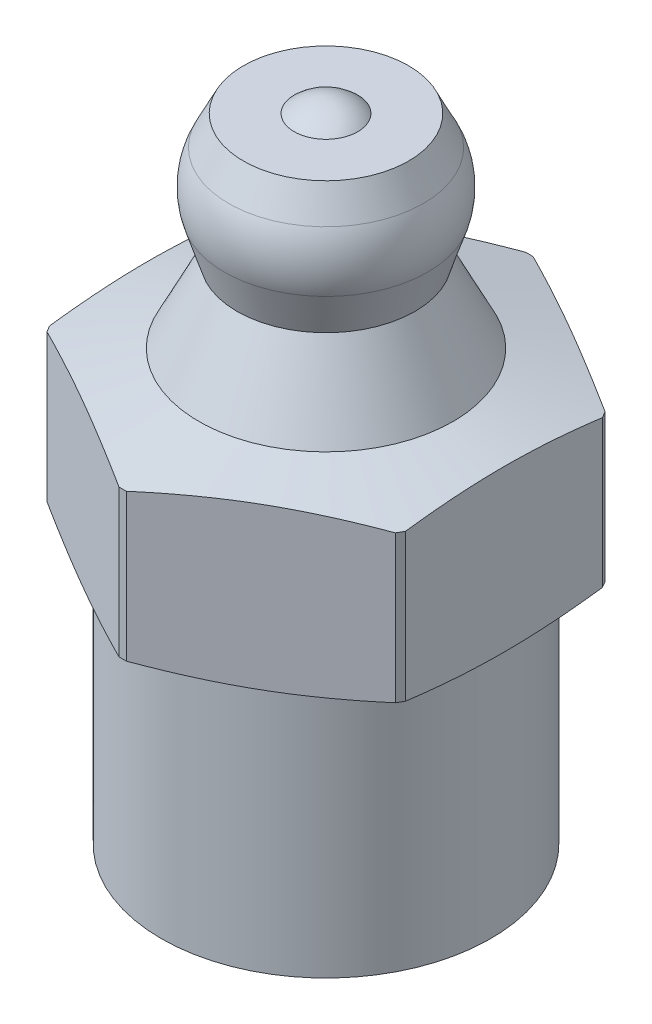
ISO-10303-21;
HEADER;
FILE_DESCRIPTION(('STEP AP214'),'2;1');
FILE_NAME('part.step','',(''),(''),'','','');
FILE_SCHEMA(('AUTOMOTIVE_DESIGN { 1 0 10303 214 1 1 1 1 }'));
ENDSEC;
DATA;
#1=APPLICATION_CONTEXT('core data for automotive mechanical design processes');
#2=APPLICATION_PROTOCOL_DEFINITION('international standard','automotive_design',2000,#1);
#3=PRODUCT_CONTEXT('',#1,'mechanical');
#4=PRODUCT('Part','Part','',(#3));
#5=PRODUCT_RELATED_PRODUCT_CATEGORY('part','',(#4));
#6=PRODUCT_DEFINITION_FORMATION('','',#4);
#7=PRODUCT_DEFINITION_CONTEXT('part definition',#1,'design');
#8=PRODUCT_DEFINITION('design','',#6,#7);
#9=PRODUCT_DEFINITION_SHAPE('','',#8);
#10=(LENGTH_UNIT() NAMED_UNIT(*) SI_UNIT(.MILLI.,.METRE.));
#11=(NAMED_UNIT(*) PLANE_ANGLE_UNIT() SI_UNIT($,.RADIAN.));
#12=(NAMED_UNIT(*) SI_UNIT($,.STERADIAN.) SOLID_ANGLE_UNIT());
#13=UNCERTAINTY_MEASURE_WITH_UNIT(LENGTH_MEASURE(1.E-05),#10,'distance_accuracy_value','');
#14=(GEOMETRIC_REPRESENTATION_CONTEXT(3) GLOBAL_UNCERTAINTY_ASSIGNED_CONTEXT((#13)) GLOBAL_UNIT_ASSIGNED_CONTEXT((#10,
#11,#12)) REPRESENTATION_CONTEXT('',''));
#15=CARTESIAN_POINT('',(0.,0.,0.));
#16=DIRECTION('',(0.,0.,1.));
#17=DIRECTION('',(1.,0.,0.));
#18=AXIS2_PLACEMENT_3D('',#15,#16,#17);
#19=CARTESIAN_POINT('',(-1.68094704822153E-12,30.7082031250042,0.));
#20=DIRECTION('',(0.523099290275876,0.611425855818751,0.593738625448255));
#21=DIRECTION('',(-0.135120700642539,-0.628346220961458,0.766109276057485));
#22=AXIS2_PLACEMENT_3D('',#19,#20,#21);
#23=SPHERICAL_SURFACE('',#22,1.43867187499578);
#24=CARTESIAN_POINT('',(0.99218749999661,31.75,0.));
#25=CARTESIAN_POINT('',(0.992183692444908,31.75,-0.0557389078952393));
#26=CARTESIAN_POINT('',(0.987468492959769,31.75,-0.111535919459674));
#27=CARTESIAN_POINT('',(0.973440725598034,31.75,-0.193989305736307));
#28=CARTESIAN_POINT('',(0.967597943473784,31.75,-0.221288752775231));
#29=CARTESIAN_POINT('',(0.953630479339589,31.75,-0.275325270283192));
#30=CARTESIAN_POINT('',(0.945503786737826,31.75,-0.302061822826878));
#31=CARTESIAN_POINT('',(0.917798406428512,31.75,-0.381032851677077));
#32=CARTESIAN_POINT('',(0.89487589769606,31.75,-0.432136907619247));
#33=CARTESIAN_POINT('',(0.840787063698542,31.75,-0.529745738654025));
#34=CARTESIAN_POINT('',(0.809620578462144,31.75,-0.576250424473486));
#35=CARTESIAN_POINT('',(0.739920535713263,31.75,-0.663373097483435));
#36=CARTESIAN_POINT('',(0.701387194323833,31.75,-0.70399125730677));
#37=CARTESIAN_POINT('',(0.61804747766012,31.75,-0.778181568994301));
#38=CARTESIAN_POINT('',(0.573240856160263,31.75,-0.81175344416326));
#39=CARTESIAN_POINT('',(0.478627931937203,31.75,-0.870898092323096));
#40=CARTESIAN_POINT('',(0.428821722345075,31.75,-0.896471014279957));
#41=CARTESIAN_POINT('',(0.325623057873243,31.75,-0.938891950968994));
#42=CARTESIAN_POINT('',(0.272230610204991,31.75,-0.955739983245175));
#43=CARTESIAN_POINT('',(0.163374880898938,31.75,-0.980233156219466));
#44=CARTESIAN_POINT('',(0.107911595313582,31.75,-0.987878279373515));
#45=CARTESIAN_POINT('',(-0.0035111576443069,31.75,-0.993748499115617));
#46=CARTESIAN_POINT('',(-0.0594706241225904,31.75,-0.991973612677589));
#47=CARTESIAN_POINT('',(-0.17029734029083,31.75,-0.979054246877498));
#48=CARTESIAN_POINT('',(-0.225164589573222,31.75,-0.967909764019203));
#49=CARTESIAN_POINT('',(-0.332249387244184,31.75,-0.936567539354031));
#50=CARTESIAN_POINT('',(-0.384466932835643,31.75,-0.91636978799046));
#51=CARTESIAN_POINT('',(-0.48476994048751,31.75,-0.867494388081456));
#52=CARTESIAN_POINT('',(-0.532855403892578,31.75,-0.838816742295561));
#53=CARTESIAN_POINT('',(-0.623529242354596,31.75,-0.773795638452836));
#54=CARTESIAN_POINT('',(-0.666117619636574,31.75,-0.737452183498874));
#55=CARTESIAN_POINT('',(-0.744588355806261,31.75,-0.658131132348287));
#56=CARTESIAN_POINT('',(-0.780470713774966,31.75,-0.615153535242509));
#57=CARTESIAN_POINT('',(-0.844510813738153,31.75,-0.523784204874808));
#58=CARTESIAN_POINT('',(-0.872668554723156,31.75,-0.475392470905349));
#59=CARTESIAN_POINT('',(-0.920460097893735,31.75,-0.374568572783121));
#60=CARTESIAN_POINT('',(-0.940093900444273,31.75,-0.322136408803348));
#61=CARTESIAN_POINT('',(-0.970280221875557,31.75,-0.214720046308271));
#62=CARTESIAN_POINT('',(-0.980832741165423,31.75,-0.159735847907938));
#63=CARTESIAN_POINT('',(-0.992556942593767,31.75,-0.048776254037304));
#64=CARTESIAN_POINT('',(-0.993728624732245,31.75,0.00719914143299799));
#65=CARTESIAN_POINT('',(-0.986657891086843,31.75,0.118552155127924));
#66=CARTESIAN_POINT('',(-0.978415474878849,31.75,0.173929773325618));
#67=CARTESIAN_POINT('',(-0.95275052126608,31.75,0.282515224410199));
#68=CARTESIAN_POINT('',(-0.935327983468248,31.75,0.335723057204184));
#69=CARTESIAN_POINT('',(-0.891797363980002,31.75,0.43845851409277));
#70=CARTESIAN_POINT('',(-0.865689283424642,31.75,0.487986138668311));
#71=CARTESIAN_POINT('',(-0.805528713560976,31.75,0.581955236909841));
#72=CARTESIAN_POINT('',(-0.771476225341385,31.75,0.626396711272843));
#73=CARTESIAN_POINT('',(-0.696393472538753,31.75,0.708931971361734));
#74=CARTESIAN_POINT('',(-0.655363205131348,31.75,0.747025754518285));
#75=CARTESIAN_POINT('',(-0.567489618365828,31.75,0.815784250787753));
#76=CARTESIAN_POINT('',(-0.520646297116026,31.75,0.846448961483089));
#77=CARTESIAN_POINT('',(-0.422476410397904,31.75,0.899478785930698));
#78=CARTESIAN_POINT('',(-0.371149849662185,31.75,0.921843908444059));
#79=CARTESIAN_POINT('',(-0.265470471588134,31.75,0.957639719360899));
#80=CARTESIAN_POINT('',(-0.211117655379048,31.75,0.971070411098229));
#81=CARTESIAN_POINT('',(-0.100928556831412,31.75,0.988616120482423));
#82=CARTESIAN_POINT('',(-0.0450922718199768,31.75,0.992731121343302));
#83=CARTESIAN_POINT('',(0.0664785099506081,31.75,0.991528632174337));
#84=CARTESIAN_POINT('',(0.122213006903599,31.75,0.98621116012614));
#85=CARTESIAN_POINT('',(0.23199837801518,31.75,0.966294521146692));
#86=CARTESIAN_POINT('',(0.286049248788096,31.75,0.951695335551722));
#87=CARTESIAN_POINT('',(0.390933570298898,31.75,0.913629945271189));
#88=CARTESIAN_POINT('',(0.441766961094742,31.75,0.890163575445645));
#89=CARTESIAN_POINT('',(0.538771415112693,31.75,0.835028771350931));
#90=CARTESIAN_POINT('',(0.584942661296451,31.75,0.803360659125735));
#91=CARTESIAN_POINT('',(0.671311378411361,31.75,0.732728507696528));
#92=CARTESIAN_POINT('',(0.711508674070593,31.75,0.693764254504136));
#93=CARTESIAN_POINT('',(0.784802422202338,31.75,0.609614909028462));
#94=CARTESIAN_POINT('',(0.817899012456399,31.75,0.564429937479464));
#95=CARTESIAN_POINT('',(0.861496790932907,31.75,0.492992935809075));
#96=CARTESIAN_POINT('',(0.875031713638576,31.75,0.468545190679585));
#97=CARTESIAN_POINT('',(0.899983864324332,31.75,0.41862099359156));
#98=CARTESIAN_POINT('',(0.911402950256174,31.75,0.393145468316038));
#99=CARTESIAN_POINT('',(0.942352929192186,31.75,0.315444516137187));
#100=CARTESIAN_POINT('',(0.958625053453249,31.75,0.261865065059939));
#101=CARTESIAN_POINT('',(0.977559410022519,31.75,0.17329619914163));
#102=CARTESIAN_POINT('',(0.983037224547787,31.75,0.138872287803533));
#103=CARTESIAN_POINT('',(0.990352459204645,31.75,0.0696398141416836));
#104=CARTESIAN_POINT('',(0.992189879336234,31.75,0.0348312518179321));
#105=CARTESIAN_POINT('',(0.99218749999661,31.75,0.));
#106=B_SPLINE_CURVE_WITH_KNOTS('',3,(#24,#25,#26,#27,#28,#29,#30,#31,#32,#33,#34,#35,#36,#37,
#38,#39,#40,#41,#42,#43,#44,#45,#46,#47,#48,#49,#50,#51,#52,#53,#54,#55,#56,#57,#58,#59,#60,#61,
#62,#63,#64,#65,#66,#67,#68,#69,#70,#71,#72,#73,#74,#75,#76,#77,#78,#79,#80,#81,#82,#83,#84,#85,
#86,#87,#88,#89,#90,#91,#92,#93,#94,#95,#96,#97,#98,#99,#100,#101,#102,#103,#104,#105),
.UNSPECIFIED.,.T.,.F.,(4,2,2,2,2,2,2,2,2,2,2,2,2,2,2,2,2,2,2,2,2,2,2,2,2,2,2,2,2,2,2,2,2,2,2,2,
2,2,2,2,4),(0.,0.167067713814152,0.250739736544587,0.334485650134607,0.501652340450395,
0.668822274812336,0.835987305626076,1.00315889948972,1.17032737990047,1.33749552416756,
1.50466398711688,1.67183214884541,1.83900037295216,2.00616877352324,2.17333711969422,
2.34050539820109,2.50767369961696,2.67484202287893,2.8420103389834,3.00917864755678,
3.17634695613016,3.34351527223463,3.5106835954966,3.67785189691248,3.84502017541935,
4.01218852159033,4.17935692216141,4.34652514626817,4.51369330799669,4.68086177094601,
4.8480299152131,5.01519839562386,5.18236998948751,5.34953502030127,5.51670495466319,
5.68387164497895,5.76761755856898,5.85128958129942,6.01835729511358,6.12275793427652,
6.22715857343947),.UNSPECIFIED.);
#107=CARTESIAN_POINT('',(0.99218749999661,31.75,0.));
#108=VERTEX_POINT('',#107);
#109=EDGE_CURVE('E215',#108,#108,#106,.T.);
#110=ORIENTED_EDGE('',*,*,#109,.T.);
#111=EDGE_LOOP('',(#110));
#112=FACE_BOUND('',#111,.T.);
#113=ADVANCED_FACE('F40',(#112),#23,.T.);
#114=CARTESIAN_POINT('',(-2.5796875,31.75,0.));
#115=DIRECTION('',(0.,-1.,0.));
#116=DIRECTION('',(0.,0.,-1.));
#117=AXIS2_PLACEMENT_3D('',#114,#115,#116);
#118=PLANE('',#117);
#119=ORIENTED_EDGE('',*,*,#109,.F.);
#120=EDGE_LOOP('',(#119));
#121=FACE_BOUND('',#120,.T.);
#122=CARTESIAN_POINT('',(0.,31.750000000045,0.));
#123=DIRECTION('',(0.,-1.,0.));
#124=DIRECTION('',(0.,0.,-1.));
#125=AXIS2_PLACEMENT_3D('',#122,#123,#124);
#126=CIRCLE('',#125,2.57968749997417);
#127=CARTESIAN_POINT('',(0.,31.750000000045,-2.57968749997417));
#128=VERTEX_POINT('',#127);
#129=EDGE_CURVE('E197',#128,#128,#126,.T.);
#130=ORIENTED_EDGE('',*,*,#129,.F.);
#131=EDGE_LOOP('',(#130));
#132=FACE_BOUND('',#131,.T.);
#133=ADVANCED_FACE('F210',(#121,#132),#118,.F.);
#134=CARTESIAN_POINT('',(0.,30.8305523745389,0.));
#135=DIRECTION('',(0.,-1.,0.));
#136=DIRECTION('',(0.,0.,-1.));
#137=AXIS2_PLACEMENT_3D('',#134,#135,#136);
#138=CONICAL_SURFACE('',#137,3.03941131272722,0.463647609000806);
#139=CARTESIAN_POINT('',(0.,30.830552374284,0.));
#140=DIRECTION('',(0.,-1.,0.));
#141=DIRECTION('',(0.,0.,-1.));
#142=AXIS2_PLACEMENT_3D('',#139,#140,#141);
#143=CIRCLE('',#142,3.039411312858);
#144=CARTESIAN_POINT('',(0.,30.830552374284,-3.039411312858));
#145=VERTEX_POINT('',#144);
#146=EDGE_CURVE('E194',#145,#145,#143,.T.);
#147=ORIENTED_EDGE('',*,*,#146,.F.);
#148=EDGE_LOOP('',(#147));
#149=FACE_BOUND('',#148,.T.);
#150=ORIENTED_EDGE('',*,*,#129,.T.);
#151=EDGE_LOOP('',(#150));
#152=FACE_BOUND('',#151,.T.);
#153=ADVANCED_FACE('F432',(#149,#152),#138,.T.);
#154=CARTESIAN_POINT('',(0.,29.7656250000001,0.));
#155=DIRECTION('',(0.,1.,0.));
#156=DIRECTION('',(0.,0.,1.));
#157=AXIS2_PLACEMENT_3D('',#154,#155,#156);
#158=DEGENERATE_TOROIDAL_SURFACE('',#157,0.909556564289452,2.38124999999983,.T.);
#159=ORIENTED_EDGE('',*,*,#146,.T.);
#160=EDGE_LOOP('',(#159));
#161=FACE_BOUND('',#160,.T.);
#162=CARTESIAN_POINT('',(0.,29.0453795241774,0.));
#163=DIRECTION('',(0.,1.,0.));
#164=DIRECTION('',(1.,0.,0.));
#165=AXIS2_PLACEMENT_3D('',#162,#163,#164);
#166=CIRCLE('',#165,3.17926976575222);
#167=CARTESIAN_POINT('',(3.17926976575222,29.0453795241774,0.));
#168=VERTEX_POINT('',#167);
#169=EDGE_CURVE('E190',#168,#168,#166,.F.);
#170=ORIENTED_EDGE('',*,*,#169,.F.);
#171=EDGE_LOOP('',(#170));
#172=FACE_BOUND('',#171,.T.);
#173=ADVANCED_FACE('F42',(#161,#172),#158,.T.);
#174=CARTESIAN_POINT('',(0.,29.0453795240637,0.));
#175=DIRECTION('',(0.,1.,0.));
#176=DIRECTION('',(0.,0.,1.));
#177=AXIS2_PLACEMENT_3D('',#174,#175,#176);
#178=CONICAL_SURFACE('',#177,3.1792697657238,0.307278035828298);
#179=ORIENTED_EDGE('',*,*,#169,.T.);
#180=EDGE_LOOP('',(#179));
#181=FACE_BOUND('',#180,.T.);
#182=CARTESIAN_POINT('',(0.,27.7812500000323,0.));
#183=DIRECTION('',(0.,-1.,0.));
#184=DIRECTION('',(-1.,0.,0.));
#185=AXIS2_PLACEMENT_3D('',#182,#183,#184);
#186=CIRCLE('',#185,2.77812499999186);
#187=CARTESIAN_POINT('',(-2.77812499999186,27.7812500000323,0.));
#188=VERTEX_POINT('',#187);
#189=EDGE_CURVE('E184',#188,#188,#186,.T.);
#190=ORIENTED_EDGE('',*,*,#189,.F.);
#191=EDGE_LOOP('',(#190));
#192=FACE_BOUND('',#191,.T.);
#193=ADVANCED_FACE('F422',(#181,#192),#178,.T.);
#194=CARTESIAN_POINT('',(0.,25.4000000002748,0.));
#195=DIRECTION('',(0.,-1.,0.));
#196=DIRECTION('',(0.,0.,-1.));
#197=AXIS2_PLACEMENT_3D('',#194,#195,#196);
#198=CONICAL_SURFACE('',#197,3.96874999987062,0.463647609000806);
#199=CARTESIAN_POINT('',(0.,25.3999999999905,0.));
#200=DIRECTION('',(0.,-1.,0.));
#201=DIRECTION('',(0.999833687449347,0.,-0.0182372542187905));
#202=AXIS2_PLACEMENT_3D('',#199,#200,#201);
#203=CIRCLE('',#202,3.96875000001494);
#204=CARTESIAN_POINT('',(3.96808994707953,25.3999999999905,-0.0723791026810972));
#205=VERTEX_POINT('',#204);
#206=EDGE_CURVE('E142',#205,#205,#203,.T.);
#207=ORIENTED_EDGE('',*,*,#206,.F.);
#208=EDGE_LOOP('',(#207));
#209=FACE_BOUND('',#208,.T.);
#210=ORIENTED_EDGE('',*,*,#189,.T.);
#211=EDGE_LOOP('',(#210));
#212=FACE_BOUND('',#211,.T.);
#213=ADVANCED_FACE('F419',(#209,#212),#198,.T.);
#214=CARTESIAN_POINT('',(0.,32.146875,0.));
#215=DIRECTION('',(0.,1.,0.));
#216=DIRECTION('',(0.,0.,1.));
#217=AXIS2_PLACEMENT_3D('',#214,#215,#216);
#218=CYLINDRICAL_SURFACE('',#217,6.35);
#219=CARTESIAN_POINT('',(0.,24.7619459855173,0.));
#220=DIRECTION('',(0.,-1.,0.));
#221=DIRECTION('',(0.999833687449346,0.,-0.0182372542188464));
#222=AXIS2_PLACEMENT_3D('',#219,#220,#221);
#223=CIRCLE('',#222,6.35000000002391);
#224=CARTESIAN_POINT('',(0.115806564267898,24.7619459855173,-6.3489439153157));
#225=VERTEX_POINT('',#224);
#226=CARTESIAN_POINT('',(-0.115806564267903,24.7619459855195,-6.3489439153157));
#227=VERTEX_POINT('',#226);
#228=EDGE_CURVE('E143',#225,#227,#223,.F.);
#229=ORIENTED_EDGE('',*,*,#228,.F.);
#230=DIRECTION('',(0.,1.,0.));
#231=VECTOR('',#230,1.);
#232=CARTESIAN_POINT('',(0.115806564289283,24.974630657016,-6.34894391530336));
#233=LINE('',#232,#231);
#234=CARTESIAN_POINT('',(0.115806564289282,20.1670307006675,-6.34894391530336));
#235=VERTEX_POINT('',#234);
#236=EDGE_CURVE('E375',#225,#235,#233,.F.);
#237=ORIENTED_EDGE('',*,*,#236,.T.);
#238=CARTESIAN_POINT('',(0.,20.167030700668,0.));
#239=DIRECTION('',(0.,1.,0.));
#240=DIRECTION('',(0.,0.,1.));
#241=AXIS2_PLACEMENT_3D('',#238,#239,#240);
#242=CIRCLE('',#241,6.35);
#243=CARTESIAN_POINT('',(-0.115806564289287,20.1670307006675,-6.34894391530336));
#244=VERTEX_POINT('',#243);
#245=EDGE_CURVE('E180',#235,#244,#242,.T.);
#246=ORIENTED_EDGE('',*,*,#245,.T.);
#247=DIRECTION('',(0.,1.,0.));
#248=VECTOR('',#247,1.);
#249=CARTESIAN_POINT('',(-0.115806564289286,24.974630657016,-6.34894391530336));
#250=LINE('',#249,#248);
#251=EDGE_CURVE('E125',#244,#227,#250,.T.);
#252=ORIENTED_EDGE('',*,*,#251,.T.);
#253=EDGE_LOOP('',(#229,#237,#246,#252));
#254=FACE_BOUND('',#253,.T.);
#255=ADVANCED_FACE('F416',(#254),#218,.T.);
#256=CARTESIAN_POINT('',(0.,32.146875,0.));
#257=DIRECTION('',(0.,1.,0.));
#258=DIRECTION('',(0.,0.,1.));
#259=AXIS2_PLACEMENT_3D('',#256,#257,#258);
#260=CYLINDRICAL_SURFACE('',#259,6.35);
#261=CARTESIAN_POINT('',(0.,24.7619459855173,0.));
#262=DIRECTION('',(0.,-1.,0.));
#263=DIRECTION('',(0.999833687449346,0.,-0.0182372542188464));
#264=AXIS2_PLACEMENT_3D('',#261,#262,#263);
#265=CIRCLE('',#264,6.35000000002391);
#266=CARTESIAN_POINT('',(5.55625,24.7619459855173,-3.07418053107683));
#267=VERTEX_POINT('',#266);
#268=CARTESIAN_POINT('',(5.44044343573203,24.7619459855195,-3.27476338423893));
#269=VERTEX_POINT('',#268);
#270=EDGE_CURVE('E169',#267,#269,#265,.F.);
#271=ORIENTED_EDGE('',*,*,#270,.F.);
#272=DIRECTION('',(0.,1.,0.));
#273=VECTOR('',#272,1.);
#274=CARTESIAN_POINT('',(5.55625,24.974630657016,-3.07418053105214));
#275=LINE('',#274,#273);
#276=CARTESIAN_POINT('',(5.55625,20.1670307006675,-3.07418053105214));
#277=VERTEX_POINT('',#276);
#278=EDGE_CURVE('E370',#267,#277,#275,.F.);
#279=ORIENTED_EDGE('',*,*,#278,.T.);
#280=CARTESIAN_POINT('',(0.,20.167030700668,0.));
#281=DIRECTION('',(0.,1.,0.));
#282=DIRECTION('',(0.,0.,1.));
#283=AXIS2_PLACEMENT_3D('',#280,#281,#282);
#284=CIRCLE('',#283,6.35);
#285=CARTESIAN_POINT('',(5.44044343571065,20.1670307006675,-3.27476338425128));
#286=VERTEX_POINT('',#285);
#287=EDGE_CURVE('E177',#277,#286,#284,.T.);
#288=ORIENTED_EDGE('',*,*,#287,.T.);
#289=DIRECTION('',(0.,1.,0.));
#290=VECTOR('',#289,1.);
#291=CARTESIAN_POINT('',(5.44044343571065,24.974630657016,-3.27476338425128));
#292=LINE('',#291,#290);
#293=EDGE_CURVE('E155',#286,#269,#292,.T.);
#294=ORIENTED_EDGE('',*,*,#293,.T.);
#295=EDGE_LOOP('',(#271,#279,#288,#294));
#296=FACE_BOUND('',#295,.T.);
#297=ADVANCED_FACE('F405',(#296),#260,.T.);
#298=CARTESIAN_POINT('',(0.,32.146875,0.));
#299=DIRECTION('',(0.,1.,0.));
#300=DIRECTION('',(0.,0.,1.));
#301=AXIS2_PLACEMENT_3D('',#298,#299,#300);
#302=CYLINDRICAL_SURFACE('',#301,6.35);
#303=CARTESIAN_POINT('',(0.,24.7619459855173,0.));
#304=DIRECTION('',(0.,-1.,0.));
#305=DIRECTION('',(0.999833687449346,0.,-0.0182372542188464));
#306=AXIS2_PLACEMENT_3D('',#303,#304,#305);
#307=CIRCLE('',#306,6.35000000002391);
#308=CARTESIAN_POINT('',(5.44044343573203,24.7619459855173,3.27476338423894));
#309=VERTEX_POINT('',#308);
#310=CARTESIAN_POINT('',(5.55625,24.7619459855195,3.07418053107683));
#311=VERTEX_POINT('',#310);
#312=EDGE_CURVE('E165',#309,#311,#307,.F.);
#313=ORIENTED_EDGE('',*,*,#312,.F.);
#314=DIRECTION('',(0.,1.,0.));
#315=VECTOR('',#314,1.);
#316=CARTESIAN_POINT('',(5.44044343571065,24.974630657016,3.27476338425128));
#317=LINE('',#316,#315);
#318=CARTESIAN_POINT('',(5.44044343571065,20.1670307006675,3.27476338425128));
#319=VERTEX_POINT('',#318);
#320=EDGE_CURVE('E365',#309,#319,#317,.F.);
#321=ORIENTED_EDGE('',*,*,#320,.T.);
#322=CARTESIAN_POINT('',(0.,20.167030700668,0.));
#323=DIRECTION('',(0.,1.,0.));
#324=DIRECTION('',(0.,0.,1.));
#325=AXIS2_PLACEMENT_3D('',#322,#323,#324);
#326=CIRCLE('',#325,6.35);
#327=CARTESIAN_POINT('',(5.55625,20.1670307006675,3.07418053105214));
#328=VERTEX_POINT('',#327);
#329=EDGE_CURVE('E172',#319,#328,#326,.T.);
#330=ORIENTED_EDGE('',*,*,#329,.T.);
#331=DIRECTION('',(0.,1.,0.));
#332=VECTOR('',#331,1.);
#333=CARTESIAN_POINT('',(5.55625,24.974630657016,3.07418053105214));
#334=LINE('',#333,#332);
#335=EDGE_CURVE('E373',#328,#311,#334,.T.);
#336=ORIENTED_EDGE('',*,*,#335,.T.);
#337=EDGE_LOOP('',(#313,#321,#330,#336));
#338=FACE_BOUND('',#337,.T.);
#339=ADVANCED_FACE('F401',(#338),#302,.T.);
#340=CARTESIAN_POINT('',(0.,32.146875,0.));
#341=DIRECTION('',(0.,1.,0.));
#342=DIRECTION('',(0.,0.,1.));
#343=AXIS2_PLACEMENT_3D('',#340,#341,#342);
#344=CYLINDRICAL_SURFACE('',#343,6.35);
#345=CARTESIAN_POINT('',(0.,24.7619459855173,0.));
#346=DIRECTION('',(0.,-1.,0.));
#347=DIRECTION('',(0.999833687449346,0.,-0.0182372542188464));
#348=AXIS2_PLACEMENT_3D('',#345,#346,#347);
#349=CIRCLE('',#348,6.35000000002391);
#350=CARTESIAN_POINT('',(-0.115806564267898,24.7619459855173,6.3489439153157));
#351=VERTEX_POINT('',#350);
#352=CARTESIAN_POINT('',(0.115806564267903,24.7619459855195,6.3489439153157));
#353=VERTEX_POINT('',#352);
#354=EDGE_CURVE('E173',#351,#353,#349,.F.);
#355=ORIENTED_EDGE('',*,*,#354,.F.);
#356=DIRECTION('',(0.,1.,0.));
#357=VECTOR('',#356,1.);
#358=CARTESIAN_POINT('',(-0.115806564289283,24.974630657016,6.34894391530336));
#359=LINE('',#358,#357);
#360=CARTESIAN_POINT('',(-0.115806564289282,20.1670307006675,6.34894391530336));
#361=VERTEX_POINT('',#360);
#362=EDGE_CURVE('E359',#351,#361,#359,.F.);
#363=ORIENTED_EDGE('',*,*,#362,.T.);
#364=CARTESIAN_POINT('',(0.,20.167030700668,0.));
#365=DIRECTION('',(0.,1.,0.));
#366=DIRECTION('',(0.,0.,1.));
#367=AXIS2_PLACEMENT_3D('',#364,#365,#366);
#368=CIRCLE('',#367,6.35);
#369=CARTESIAN_POINT('',(0.115806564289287,20.1670307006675,6.34894391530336));
#370=VERTEX_POINT('',#369);
#371=EDGE_CURVE('E170',#361,#370,#368,.T.);
#372=ORIENTED_EDGE('',*,*,#371,.T.);
#373=DIRECTION('',(0.,1.,0.));
#374=VECTOR('',#373,1.);
#375=CARTESIAN_POINT('',(0.115806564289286,24.974630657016,6.34894391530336));
#376=LINE('',#375,#374);
#377=EDGE_CURVE('E368',#370,#353,#376,.T.);
#378=ORIENTED_EDGE('',*,*,#377,.T.);
#379=EDGE_LOOP('',(#355,#363,#372,#378));
#380=FACE_BOUND('',#379,.T.);
#381=ADVANCED_FACE('F406',(#380),#344,.T.);
#382=CARTESIAN_POINT('',(0.,32.146875,0.));
#383=DIRECTION('',(0.,1.,0.));
#384=DIRECTION('',(0.,0.,1.));
#385=AXIS2_PLACEMENT_3D('',#382,#383,#384);
#386=CYLINDRICAL_SURFACE('',#385,6.35);
#387=CARTESIAN_POINT('',(0.,24.7619459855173,0.));
#388=DIRECTION('',(0.,-1.,0.));
#389=DIRECTION('',(0.999833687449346,0.,-0.0182372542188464));
#390=AXIS2_PLACEMENT_3D('',#387,#388,#389);
#391=CIRCLE('',#390,6.35000000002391);
#392=CARTESIAN_POINT('',(-5.44044343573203,24.7619459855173,-3.27476338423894));
#393=VERTEX_POINT('',#392);
#394=CARTESIAN_POINT('',(-5.55625,24.7619459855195,-3.07418053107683));
#395=VERTEX_POINT('',#394);
#396=EDGE_CURVE('E132',#393,#395,#391,.F.);
#397=ORIENTED_EDGE('',*,*,#396,.F.);
#398=DIRECTION('',(0.,1.,0.));
#399=VECTOR('',#398,1.);
#400=CARTESIAN_POINT('',(-5.44044343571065,24.974630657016,-3.27476338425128));
#401=LINE('',#400,#399);
#402=CARTESIAN_POINT('',(-5.44044343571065,20.1670307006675,-3.27476338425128));
#403=VERTEX_POINT('',#402);
#404=EDGE_CURVE('E137',#393,#403,#401,.F.);
#405=ORIENTED_EDGE('',*,*,#404,.T.);
#406=CARTESIAN_POINT('',(0.,20.167030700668,0.));
#407=DIRECTION('',(0.,1.,0.));
#408=DIRECTION('',(0.,0.,1.));
#409=AXIS2_PLACEMENT_3D('',#406,#407,#408);
#410=CIRCLE('',#409,6.35);
#411=CARTESIAN_POINT('',(-5.55625,20.1670307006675,-3.07418053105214));
#412=VERTEX_POINT('',#411);
#413=EDGE_CURVE('E167',#403,#412,#410,.T.);
#414=ORIENTED_EDGE('',*,*,#413,.T.);
#415=DIRECTION('',(0.,1.,0.));
#416=VECTOR('',#415,1.);
#417=CARTESIAN_POINT('',(-5.55625,24.974630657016,-3.07418053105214));
#418=LINE('',#417,#416);
#419=EDGE_CURVE('E140',#412,#395,#418,.T.);
#420=ORIENTED_EDGE('',*,*,#419,.T.);
#421=EDGE_LOOP('',(#397,#405,#414,#420));
#422=FACE_BOUND('',#421,.T.);
#423=ADVANCED_FACE('F134',(#422),#386,.T.);
#424=CARTESIAN_POINT('',(0.,24.7619459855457,0.));
#425=DIRECTION('',(0.,-1.,0.));
#426=DIRECTION('',(0.,0.,-1.));
#427=AXIS2_PLACEMENT_3D('',#424,#425,#426);
#428=CONICAL_SURFACE('',#427,6.34999999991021,1.3089969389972);
#429=ORIENTED_EDGE('',*,*,#206,.T.);
#430=EDGE_LOOP('',(#429));
#431=FACE_BOUND('',#430,.T.);
#432=ORIENTED_EDGE('',*,*,#312,.T.);
#433=CARTESIAN_POINT('',(5.55625,24.7619459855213,3.074180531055));
#434=CARTESIAN_POINT('',(5.55625006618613,24.7961830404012,2.81040105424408));
#435=CARTESIAN_POINT('',(5.55625003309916,24.8270775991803,2.54614706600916));
#436=CARTESIAN_POINT('',(5.55624996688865,24.8809463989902,2.01674080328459));
#437=CARTESIAN_POINT('',(5.5562499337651,24.9039177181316,1.75158823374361));
#438=CARTESIAN_POINT('',(5.55625006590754,24.9405868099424,1.22194222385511));
#439=CARTESIAN_POINT('',(5.55625023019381,24.9543298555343,0.957452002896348));
#440=CARTESIAN_POINT('',(5.55624976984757,24.971873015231,0.428182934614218));
#441=CARTESIAN_POINT('',(5.55624914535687,24.9756749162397,0.16340414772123));
#442=CARTESIAN_POINT('',(5.55624919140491,24.9731718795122,-0.349293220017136));
#443=CARTESIAN_POINT('',(5.55624978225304,24.9674931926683,-0.597215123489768));
#444=CARTESIAN_POINT('',(5.55625021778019,24.9475328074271,-1.09274550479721));
#445=CARTESIAN_POINT('',(5.55625006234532,24.9332497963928,-1.34035392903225));
#446=CARTESIAN_POINT('',(5.5562499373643,24.8967520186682,-1.83613134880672));
#447=CARTESIAN_POINT('',(5.5562499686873,24.8745006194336,-2.08429758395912));
#448=CARTESIAN_POINT('',(5.5562500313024,24.8231210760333,-2.5798393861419));
#449=CARTESIAN_POINT('',(5.5562500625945,24.7939951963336,-2.82721518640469));
#450=CARTESIAN_POINT('',(5.55625,24.7619459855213,-3.074180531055));
#451=B_SPLINE_CURVE_WITH_KNOTS('',3,(#433,#434,#435,#436,#437,#438,#439,#440,#441,#442,#443,
#444,#445,#446,#447,#448,#449,#450),.UNSPECIFIED.,.F.,.F.,(4,2,2,2,2,2,2,2,4),(0.,
0.798015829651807,1.59632563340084,2.39068982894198,3.18491122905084,3.92871633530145,
4.67263494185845,5.42001837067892,6.16715595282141),.UNSPECIFIED.);
#452=EDGE_CURVE('E258',#311,#267,#451,.T.);
#453=ORIENTED_EDGE('',*,*,#452,.T.);
#454=ORIENTED_EDGE('',*,*,#270,.T.);
#455=CARTESIAN_POINT('',(5.44044343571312,24.7619459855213,-3.27476338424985));
#456=CARTESIAN_POINT('',(5.21928476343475,24.7950887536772,-3.40244940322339));
#457=CARTESIAN_POINT('',(4.99774352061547,24.8251024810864,-3.5303562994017));
#458=CARTESIAN_POINT('',(4.55393028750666,24.877744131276,-3.78659198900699));
#459=CARTESIAN_POINT('',(4.33165806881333,24.9003694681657,-3.91492091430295));
#460=CARTESIAN_POINT('',(3.88763815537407,24.9369939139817,-4.17127593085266));
#461=CARTESIAN_POINT('',(3.66589304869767,24.9510338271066,-4.29930052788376));
#462=CARTESIAN_POINT('',(3.22214026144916,24.9698514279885,-4.55550131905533));
#463=CARTESIAN_POINT('',(3.00013263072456,24.9746306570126,-4.68367748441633));
#464=CARTESIAN_POINT('',(2.55611736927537,24.9746306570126,-4.94002981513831));
#465=CARTESIAN_POINT('',(2.33410973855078,24.9698514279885,-5.0682059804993));
#466=CARTESIAN_POINT('',(1.89035695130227,24.9510338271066,-5.32440677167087));
#467=CARTESIAN_POINT('',(1.66861184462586,24.9369939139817,-5.45243136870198));
#468=CARTESIAN_POINT('',(1.2245919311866,24.9003694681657,-5.70878638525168));
#469=CARTESIAN_POINT('',(1.00231971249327,24.877744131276,-5.83711531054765));
#470=CARTESIAN_POINT('',(0.55850647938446,24.8251024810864,-6.09335100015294));
#471=CARTESIAN_POINT('',(0.336965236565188,24.7950887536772,-6.22125789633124));
#472=CARTESIAN_POINT('',(0.115806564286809,24.7619459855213,-6.34894391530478));
#473=B_SPLINE_CURVE_WITH_KNOTS('',3,(#455,#456,#457,#458,#459,#460,#461,#462,#463,#464,#465,
#466,#467,#468,#469,#470,#471,#472),.UNSPECIFIED.,.F.,.F.,(4,2,2,2,2,2,2,2,4),(0.,
0.772575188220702,1.54542048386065,2.31456351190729,3.08357851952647,3.85259352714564,
4.62173655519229,5.39458185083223,6.16715703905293),.UNSPECIFIED.);
#474=EDGE_CURVE('E157',#269,#225,#473,.T.);
#475=ORIENTED_EDGE('',*,*,#474,.T.);
#476=ORIENTED_EDGE('',*,*,#228,.T.);
#477=CARTESIAN_POINT('',(-0.115806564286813,24.7619459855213,-6.34894391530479));
#478=CARTESIAN_POINT('',(-0.33696523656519,24.7950887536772,-6.22125789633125));
#479=CARTESIAN_POINT('',(-0.558506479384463,24.8251024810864,-6.09335100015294));
#480=CARTESIAN_POINT('',(-1.00231971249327,24.877744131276,-5.83711531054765));
#481=CARTESIAN_POINT('',(-1.2245919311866,24.9003694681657,-5.70878638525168));
#482=CARTESIAN_POINT('',(-1.66861184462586,24.9369939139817,-5.45243136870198));
#483=CARTESIAN_POINT('',(-1.89035695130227,24.9510338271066,-5.32440677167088));
#484=CARTESIAN_POINT('',(-2.33410973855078,24.9698514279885,-5.06820598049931));
#485=CARTESIAN_POINT('',(-2.55611736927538,24.9746306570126,-4.94002981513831));
#486=CARTESIAN_POINT('',(-3.00013263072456,24.9746306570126,-4.68367748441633));
#487=CARTESIAN_POINT('',(-3.22214026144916,24.9698514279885,-4.55550131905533));
#488=CARTESIAN_POINT('',(-3.66589304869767,24.9510338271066,-4.29930052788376));
#489=CARTESIAN_POINT('',(-3.88763815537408,24.9369939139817,-4.17127593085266));
#490=CARTESIAN_POINT('',(-4.33165806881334,24.9003694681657,-3.91492091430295));
#491=CARTESIAN_POINT('',(-4.55393028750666,24.877744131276,-3.78659198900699));
#492=CARTESIAN_POINT('',(-4.99774352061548,24.8251024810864,-3.5303562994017));
#493=CARTESIAN_POINT('',(-5.21928476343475,24.7950887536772,-3.40244940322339));
#494=CARTESIAN_POINT('',(-5.44044343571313,24.7619459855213,-3.27476338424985));
#495=B_SPLINE_CURVE_WITH_KNOTS('',3,(#477,#478,#479,#480,#481,#482,#483,#484,#485,#486,#487,
#488,#489,#490,#491,#492,#493,#494),.UNSPECIFIED.,.F.,.F.,(4,2,2,2,2,2,2,2,4),(0.,
0.772575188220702,1.54542048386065,2.31456351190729,3.08357851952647,3.85259352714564,
4.62173655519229,5.39458185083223,6.16715703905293),.UNSPECIFIED.);
#496=EDGE_CURVE('E146',#227,#393,#495,.T.);
#497=ORIENTED_EDGE('',*,*,#496,.T.);
#498=ORIENTED_EDGE('',*,*,#396,.T.);
#499=CARTESIAN_POINT('',(-5.55625,24.7619459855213,-3.07418053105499));
#500=CARTESIAN_POINT('',(-5.55625016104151,24.7961831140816,-2.81040104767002));
#501=CARTESIAN_POINT('',(-5.55625008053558,24.8270776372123,-2.54614705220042));
#502=CARTESIAN_POINT('',(-5.55624991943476,24.8809463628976,-2.01674079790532));
#503=CARTESIAN_POINT('',(-5.55624983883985,24.9039176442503,-1.75158824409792));
#504=CARTESIAN_POINT('',(-5.55625016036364,24.9405868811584,-1.22194224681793));
#505=CARTESIAN_POINT('',(-5.55625056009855,24.9543301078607,-0.957452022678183));
#506=CARTESIAN_POINT('',(-5.55624944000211,24.971872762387,-0.428182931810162));
#507=CARTESIAN_POINT('',(-5.55624792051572,24.9756739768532,-0.163404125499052));
#508=CARTESIAN_POINT('',(-5.55624803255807,24.9731709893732,0.349293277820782));
#509=CARTESIAN_POINT('',(-5.55624947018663,24.9674929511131,0.597215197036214));
#510=CARTESIAN_POINT('',(-5.55625052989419,24.9475330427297,1.09274558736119));
#511=CARTESIAN_POINT('',(-5.55625015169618,24.933249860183,1.34035400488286));
#512=CARTESIAN_POINT('',(-5.5562498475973,24.8967519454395,1.83613139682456));
#513=CARTESIAN_POINT('',(-5.55624992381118,24.8745005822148,2.08429761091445));
#514=CARTESIAN_POINT('',(-5.55625007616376,24.8231211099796,2.57983939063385));
#515=CARTESIAN_POINT('',(-5.55625015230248,24.7939952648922,2.82721518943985));
#516=CARTESIAN_POINT('',(-5.55625,24.7619459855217,3.07418053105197));
#517=B_SPLINE_CURVE_WITH_KNOTS('',3,(#499,#500,#501,#502,#503,#504,#505,#506,#507,#508,#509,
#510,#511,#512,#513,#514,#515,#516),.UNSPECIFIED.,.F.,.F.,(4,2,2,2,2,2,2,2,4),(0.,
0.798015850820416,1.59632560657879,2.39068981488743,3.18491126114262,3.92871638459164,
4.67263497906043,5.42001834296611,6.16715591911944),.UNSPECIFIED.);
#518=CARTESIAN_POINT('',(-5.55625,24.7619459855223,3.07418053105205));
#519=VERTEX_POINT('',#518);
#520=EDGE_CURVE('E266',#395,#519,#517,.T.);
#521=ORIENTED_EDGE('',*,*,#520,.T.);
#522=CARTESIAN_POINT('',(0.,24.761945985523,0.));
#523=DIRECTION('',(0.,1.,0.));
#524=DIRECTION('',(0.,0.,1.));
#525=AXIS2_PLACEMENT_3D('',#522,#523,#524);
#526=CIRCLE('',#525,6.35);
#527=CARTESIAN_POINT('',(-5.44044343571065,24.7619459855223,3.27476338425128));
#528=VERTEX_POINT('',#527);
#529=EDGE_CURVE('E162',#528,#519,#526,.F.);
#530=ORIENTED_EDGE('',*,*,#529,.F.);
#531=CARTESIAN_POINT('',(-5.4404434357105,24.7619459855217,3.27476338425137));
#532=CARTESIAN_POINT('',(-5.21928476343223,24.7950887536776,3.40244940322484));
#533=CARTESIAN_POINT('',(-4.99774352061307,24.8251024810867,3.53035629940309));
#534=CARTESIAN_POINT('',(-4.55393028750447,24.8777441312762,3.78659198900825));
#535=CARTESIAN_POINT('',(-4.33165806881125,24.9003694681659,3.91492091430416));
#536=CARTESIAN_POINT('',(-3.88763815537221,24.9369939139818,4.17127593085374));
#537=CARTESIAN_POINT('',(-3.66589304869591,24.9510338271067,4.29930052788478));
#538=CARTESIAN_POINT('',(-3.22214026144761,24.9698514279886,4.55550131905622));
#539=CARTESIAN_POINT('',(-3.00013263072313,24.9746306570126,4.68367748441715));
#540=CARTESIAN_POINT('',(-2.55611736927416,24.9746306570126,4.94002981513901));
#541=CARTESIAN_POINT('',(-2.33410973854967,24.9698514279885,5.06820598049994));
#542=CARTESIAN_POINT('',(-1.89035695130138,24.9510338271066,5.32440677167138));
#543=CARTESIAN_POINT('',(-1.66861184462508,24.9369939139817,5.45243136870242));
#544=CARTESIAN_POINT('',(-1.22459193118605,24.9003694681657,5.708786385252));
#545=CARTESIAN_POINT('',(-1.00231971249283,24.877744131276,5.8371153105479));
#546=CARTESIAN_POINT('',(-0.55850647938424,24.8251024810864,6.09335100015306));
#547=CARTESIAN_POINT('',(-0.336965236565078,24.7950887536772,6.22125789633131));
#548=CARTESIAN_POINT('',(-0.11580656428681,24.7619459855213,6.34894391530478));
#549=B_SPLINE_CURVE_WITH_KNOTS('',3,(#531,#532,#533,#534,#535,#536,#537,#538,#539,#540,#541,
#542,#543,#544,#545,#546,#547,#548),.UNSPECIFIED.,.F.,.F.,(4,2,2,2,2,2,2,2,4),(0.,
0.772575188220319,1.54542048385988,2.31456351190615,3.08357851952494,3.85259352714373,
4.62173655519,5.39458185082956,6.16715703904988),.UNSPECIFIED.);
#550=EDGE_CURVE('E278',#528,#351,#549,.T.);
#551=ORIENTED_EDGE('',*,*,#550,.T.);
#552=ORIENTED_EDGE('',*,*,#354,.T.);
#553=CARTESIAN_POINT('',(0.115806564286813,24.7619459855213,6.34894391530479));
#554=CARTESIAN_POINT('',(0.33696523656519,24.7950887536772,6.22125789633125));
#555=CARTESIAN_POINT('',(0.558506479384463,24.8251024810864,6.09335100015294));
#556=CARTESIAN_POINT('',(1.00231971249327,24.877744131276,5.83711531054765));
#557=CARTESIAN_POINT('',(1.2245919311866,24.9003694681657,5.70878638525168));
#558=CARTESIAN_POINT('',(1.66861184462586,24.9369939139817,5.45243136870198));
#559=CARTESIAN_POINT('',(1.89035695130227,24.9510338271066,5.32440677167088));
#560=CARTESIAN_POINT('',(2.33410973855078,24.9698514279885,5.06820598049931));
#561=CARTESIAN_POINT('',(2.55611736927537,24.9746306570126,4.94002981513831));
#562=CARTESIAN_POINT('',(3.00013263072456,24.9746306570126,4.68367748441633));
#563=CARTESIAN_POINT('',(3.22214026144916,24.9698514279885,4.55550131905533));
#564=CARTESIAN_POINT('',(3.66589304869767,24.9510338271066,4.29930052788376));
#565=CARTESIAN_POINT('',(3.88763815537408,24.9369939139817,4.17127593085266));
#566=CARTESIAN_POINT('',(4.33165806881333,24.9003694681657,3.91492091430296));
#567=CARTESIAN_POINT('',(4.55393028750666,24.877744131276,3.78659198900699));
#568=CARTESIAN_POINT('',(4.99774352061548,24.8251024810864,3.5303562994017));
#569=CARTESIAN_POINT('',(5.21928476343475,24.7950887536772,3.40244940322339));
#570=CARTESIAN_POINT('',(5.44044343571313,24.7619459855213,3.27476338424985));
#571=B_SPLINE_CURVE_WITH_KNOTS('',3,(#553,#554,#555,#556,#557,#558,#559,#560,#561,#562,#563,
#564,#565,#566,#567,#568,#569,#570),.UNSPECIFIED.,.F.,.F.,(4,2,2,2,2,2,2,2,4),(0.,
0.772575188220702,1.54542048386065,2.31456351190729,3.08357851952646,3.85259352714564,
4.62173655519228,5.39458185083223,6.16715703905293),.UNSPECIFIED.);
#572=EDGE_CURVE('E249',#353,#309,#571,.T.);
#573=ORIENTED_EDGE('',*,*,#572,.T.);
#574=EDGE_LOOP('',(#432,#453,#454,#475,#476,#497,#498,#521,#530,#551,#552,#573));
#575=FACE_BOUND('',#574,.T.);
#576=ADVANCED_FACE('F148',(#431,#575),#428,.T.);
#577=CARTESIAN_POINT('',(0.,32.146875,0.));
#578=DIRECTION('',(0.,1.,0.));
#579=DIRECTION('',(0.,0.,1.));
#580=AXIS2_PLACEMENT_3D('',#577,#578,#579);
#581=CYLINDRICAL_SURFACE('',#580,6.35);
#582=CARTESIAN_POINT('',(0.,20.167030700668,0.));
#583=DIRECTION('',(0.,1.,0.));
#584=DIRECTION('',(0.,0.,1.));
#585=AXIS2_PLACEMENT_3D('',#582,#583,#584);
#586=CIRCLE('',#585,6.35);
#587=CARTESIAN_POINT('',(-5.55625,20.1670307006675,3.07418053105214));
#588=VERTEX_POINT('',#587);
#589=CARTESIAN_POINT('',(-5.44044343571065,20.1670307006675,3.27476338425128));
#590=VERTEX_POINT('',#589);
#591=EDGE_CURVE('E59',#588,#590,#586,.T.);
#592=ORIENTED_EDGE('',*,*,#591,.T.);
#593=DIRECTION('',(0.,1.,0.));
#594=VECTOR('',#593,1.);
#595=CARTESIAN_POINT('',(-5.44044343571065,24.974630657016,3.27476338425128));
#596=LINE('',#595,#594);
#597=EDGE_CURVE('E362',#590,#528,#596,.T.);
#598=ORIENTED_EDGE('',*,*,#597,.T.);
#599=ORIENTED_EDGE('',*,*,#529,.T.);
#600=DIRECTION('',(0.,1.,0.));
#601=VECTOR('',#600,1.);
#602=CARTESIAN_POINT('',(-5.55625,24.974630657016,3.07418053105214));
#603=LINE('',#602,#601);
#604=EDGE_CURVE('E272',#519,#588,#603,.F.);
#605=ORIENTED_EDGE('',*,*,#604,.T.);
#606=EDGE_LOOP('',(#592,#598,#599,#605));
#607=FACE_BOUND('',#606,.T.);
#608=ADVANCED_FACE('F243',(#607),#581,.T.);
#609=CARTESIAN_POINT('',(0.,24.974630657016,-6.4158048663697));
#610=DIRECTION('',(0.499999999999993,0.,0.866025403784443));
#611=DIRECTION('',(0.866025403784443,0.,-0.499999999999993));
#612=AXIS2_PLACEMENT_3D('',#609,#610,#611);
#613=PLANE('',#612);
#614=ORIENTED_EDGE('',*,*,#496,.F.);
#615=ORIENTED_EDGE('',*,*,#251,.F.);
#616=CARTESIAN_POINT('',(-5.44044343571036,20.167030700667,-3.27476338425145));
#617=CARTESIAN_POINT('',(-5.21928476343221,20.1338879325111,-3.40244940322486));
#618=CARTESIAN_POINT('',(-4.99774352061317,20.1038742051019,-3.53035629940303));
#619=CARTESIAN_POINT('',(-4.55393028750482,20.0512325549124,-3.78659198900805));
#620=CARTESIAN_POINT('',(-4.33165806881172,20.0286072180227,-3.91492091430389));
#621=CARTESIAN_POINT('',(-3.88763815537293,19.9919827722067,-4.17127593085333));
#622=CARTESIAN_POINT('',(-3.66589304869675,19.9779428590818,-4.2993005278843));
#623=CARTESIAN_POINT('',(-3.2221402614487,19.9591252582,-4.5555013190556));
#624=CARTESIAN_POINT('',(-3.00013263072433,19.9543460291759,-4.68367748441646));
#625=CARTESIAN_POINT('',(-2.55611736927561,19.9543460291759,-4.94002981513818));
#626=CARTESIAN_POINT('',(-2.33410973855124,19.9591252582,-5.06820598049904));
#627=CARTESIAN_POINT('',(-1.89035695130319,19.9779428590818,-5.32440677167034));
#628=CARTESIAN_POINT('',(-1.66861184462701,19.9919827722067,-5.45243136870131));
#629=CARTESIAN_POINT('',(-1.22459193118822,20.0286072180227,-5.70878638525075));
#630=CARTESIAN_POINT('',(-1.00231971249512,20.0512325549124,-5.83711531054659));
#631=CARTESIAN_POINT('',(-0.558506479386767,20.1038742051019,-6.09335100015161));
#632=CARTESIAN_POINT('',(-0.336965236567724,20.1338879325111,-6.22125789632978));
#633=CARTESIAN_POINT('',(-0.115806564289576,20.167030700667,-6.34894391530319));
#634=B_SPLINE_CURVE_WITH_KNOTS('',3,(#616,#617,#618,#619,#620,#621,#622,#623,#624,#625,#626,
#627,#628,#629,#630,#631,#632,#633),.UNSPECIFIED.,.F.,.F.,(4,2,2,2,2,2,2,2,4),(0.,
0.772575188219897,1.54542048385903,2.31456351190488,3.08357851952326,3.85259352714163,
4.62173655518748,5.39458185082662,6.16715703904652),.UNSPECIFIED.);
#635=EDGE_CURVE('E154',#403,#244,#634,.T.);
#636=ORIENTED_EDGE('',*,*,#635,.F.);
#637=ORIENTED_EDGE('',*,*,#404,.F.);
#638=EDGE_LOOP('',(#614,#615,#636,#637));
#639=FACE_BOUND('',#638,.T.);
#640=ADVANCED_FACE('F152',(#639),#613,.F.);
#641=CARTESIAN_POINT('',(5.55625,24.974630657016,-3.2079024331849));
#642=DIRECTION('',(-0.499999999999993,0.,0.866025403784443));
#643=DIRECTION('',(0.866025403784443,0.,0.499999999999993));
#644=AXIS2_PLACEMENT_3D('',#641,#642,#643);
#645=PLANE('',#644);
#646=ORIENTED_EDGE('',*,*,#474,.F.);
#647=ORIENTED_EDGE('',*,*,#293,.F.);
#648=CARTESIAN_POINT('',(0.115806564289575,20.1670307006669,-6.34894391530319));
#649=CARTESIAN_POINT('',(0.336965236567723,20.1338879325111,-6.22125789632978));
#650=CARTESIAN_POINT('',(0.558506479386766,20.1038742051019,-6.0933510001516));
#651=CARTESIAN_POINT('',(1.00231971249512,20.0512325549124,-5.83711531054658));
#652=CARTESIAN_POINT('',(1.22459193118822,20.0286072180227,-5.70878638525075));
#653=CARTESIAN_POINT('',(1.66861184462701,19.9919827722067,-5.45243136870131));
#654=CARTESIAN_POINT('',(1.89035695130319,19.9779428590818,-5.32440677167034));
#655=CARTESIAN_POINT('',(2.33410973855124,19.9591252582,-5.06820598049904));
#656=CARTESIAN_POINT('',(2.5561173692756,19.9543460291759,-4.94002981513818));
#657=CARTESIAN_POINT('',(3.00013263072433,19.9543460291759,-4.68367748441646));
#658=CARTESIAN_POINT('',(3.2221402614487,19.9591252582,-4.5555013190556));
#659=CARTESIAN_POINT('',(3.66589304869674,19.9779428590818,-4.29930052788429));
#660=CARTESIAN_POINT('',(3.88763815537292,19.9919827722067,-4.17127593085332));
#661=CARTESIAN_POINT('',(4.33165806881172,20.0286072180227,-3.91492091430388));
#662=CARTESIAN_POINT('',(4.55393028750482,20.0512325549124,-3.78659198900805));
#663=CARTESIAN_POINT('',(4.99774352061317,20.1038742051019,-3.53035629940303));
#664=CARTESIAN_POINT('',(5.21928476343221,20.1338879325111,-3.40244940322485));
#665=CARTESIAN_POINT('',(5.44044343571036,20.167030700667,-3.27476338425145));
#666=B_SPLINE_CURVE_WITH_KNOTS('',3,(#648,#649,#650,#651,#652,#653,#654,#655,#656,#657,#658,
#659,#660,#661,#662,#663,#664,#665),.UNSPECIFIED.,.F.,.F.,(4,2,2,2,2,2,2,2,4),(0.,
0.772575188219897,1.54542048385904,2.31456351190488,3.08357851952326,3.85259352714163,
4.62173655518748,5.39458185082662,6.16715703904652),.UNSPECIFIED.);
#667=EDGE_CURVE('E318',#235,#286,#666,.T.);
#668=ORIENTED_EDGE('',*,*,#667,.F.);
#669=ORIENTED_EDGE('',*,*,#236,.F.);
#670=EDGE_LOOP('',(#646,#647,#668,#669));
#671=FACE_BOUND('',#670,.T.);
#672=ADVANCED_FACE('F326',(#671),#645,.F.);
#673=CARTESIAN_POINT('',(5.55625,24.974630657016,3.2079024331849));
#674=DIRECTION('',(-1.,0.,0.));
#675=DIRECTION('',(0.,0.,1.));
#676=AXIS2_PLACEMENT_3D('',#673,#674,#675);
#677=PLANE('',#676);
#678=ORIENTED_EDGE('',*,*,#452,.F.);
#679=ORIENTED_EDGE('',*,*,#335,.F.);
#680=CARTESIAN_POINT('',(5.55625,20.167030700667,-3.0741805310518));
#681=CARTESIAN_POINT('',(5.55625000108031,20.1338879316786,-2.81880849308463));
#682=CARTESIAN_POINT('',(5.55625000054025,20.1038742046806,-2.56299470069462));
#683=CARTESIAN_POINT('',(5.55624999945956,20.0512325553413,-2.05052332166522));
#684=CARTESIAN_POINT('',(5.55624999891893,20.0286072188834,-1.79386547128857));
#685=CARTESIAN_POINT('',(5.55625000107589,19.9919827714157,-1.28115543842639));
#686=CARTESIAN_POINT('',(5.55625000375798,19.9779428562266,-1.02510624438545));
#687=CARTESIAN_POINT('',(5.55624999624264,19.959125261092,-0.512704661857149));
#688=CARTESIAN_POINT('',(5.55624998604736,19.9543460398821,-0.256352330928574));
#689=CARTESIAN_POINT('',(5.55624998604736,19.9543460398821,0.256352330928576));
#690=CARTESIAN_POINT('',(5.55624999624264,19.959125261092,0.512704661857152));
#691=CARTESIAN_POINT('',(5.55625000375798,19.9779428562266,1.02510624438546));
#692=CARTESIAN_POINT('',(5.55625000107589,19.9919827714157,1.28115543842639));
#693=CARTESIAN_POINT('',(5.55624999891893,20.0286072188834,1.79386547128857));
#694=CARTESIAN_POINT('',(5.55624999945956,20.0512325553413,2.05052332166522));
#695=CARTESIAN_POINT('',(5.55625000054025,20.1038742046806,2.56299470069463));
#696=CARTESIAN_POINT('',(5.55625000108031,20.1338879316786,2.81880849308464));
#697=CARTESIAN_POINT('',(5.55625,20.167030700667,3.0741805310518));
#698=B_SPLINE_CURVE_WITH_KNOTS('',3,(#680,#681,#682,#683,#684,#685,#686,#687,#688,#689,#690,
#691,#692,#693,#694,#695,#696,#697),.UNSPECIFIED.,.F.,.F.,(4,2,2,2,2,2,2,2,4),(0.,
0.772575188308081,1.54542048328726,2.31456351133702,3.08357851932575,3.85259352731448,
4.62173655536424,5.39458185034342,6.1671570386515),.UNSPECIFIED.);
#699=EDGE_CURVE('E312',#277,#328,#698,.T.);
#700=ORIENTED_EDGE('',*,*,#699,.F.);
#701=ORIENTED_EDGE('',*,*,#278,.F.);
#702=EDGE_LOOP('',(#678,#679,#700,#701));
#703=FACE_BOUND('',#702,.T.);
#704=ADVANCED_FACE('F323',(#703),#677,.F.);
#705=CARTESIAN_POINT('',(0.,24.974630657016,6.4158048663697));
#706=DIRECTION('',(-0.499999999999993,0.,-0.866025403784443));
#707=DIRECTION('',(-0.866025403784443,0.,0.499999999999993));
#708=AXIS2_PLACEMENT_3D('',#705,#706,#707);
#709=PLANE('',#708);
#710=ORIENTED_EDGE('',*,*,#572,.F.);
#711=ORIENTED_EDGE('',*,*,#377,.F.);
#712=CARTESIAN_POINT('',(5.44044343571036,20.167030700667,3.27476338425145));
#713=CARTESIAN_POINT('',(5.21928476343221,20.1338879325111,3.40244940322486));
#714=CARTESIAN_POINT('',(4.99774352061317,20.1038742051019,3.53035629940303));
#715=CARTESIAN_POINT('',(4.55393028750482,20.0512325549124,3.78659198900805));
#716=CARTESIAN_POINT('',(4.33165806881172,20.0286072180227,3.91492091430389));
#717=CARTESIAN_POINT('',(3.88763815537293,19.9919827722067,4.17127593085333));
#718=CARTESIAN_POINT('',(3.66589304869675,19.9779428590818,4.2993005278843));
#719=CARTESIAN_POINT('',(3.2221402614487,19.9591252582,4.5555013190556));
#720=CARTESIAN_POINT('',(3.00013263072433,19.9543460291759,4.68367748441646));
#721=CARTESIAN_POINT('',(2.55611736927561,19.9543460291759,4.94002981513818));
#722=CARTESIAN_POINT('',(2.33410973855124,19.9591252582,5.06820598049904));
#723=CARTESIAN_POINT('',(1.89035695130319,19.9779428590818,5.32440677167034));
#724=CARTESIAN_POINT('',(1.66861184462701,19.9919827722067,5.45243136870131));
#725=CARTESIAN_POINT('',(1.22459193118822,20.0286072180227,5.70878638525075));
#726=CARTESIAN_POINT('',(1.00231971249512,20.0512325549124,5.83711531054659));
#727=CARTESIAN_POINT('',(0.558506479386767,20.1038742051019,6.09335100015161));
#728=CARTESIAN_POINT('',(0.336965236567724,20.1338879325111,6.22125789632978));
#729=CARTESIAN_POINT('',(0.115806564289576,20.167030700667,6.34894391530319));
#730=B_SPLINE_CURVE_WITH_KNOTS('',3,(#712,#713,#714,#715,#716,#717,#718,#719,#720,#721,#722,
#723,#724,#725,#726,#727,#728,#729),.UNSPECIFIED.,.F.,.F.,(4,2,2,2,2,2,2,2,4),(0.,
0.772575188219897,1.54542048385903,2.31456351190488,3.08357851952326,3.85259352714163,
4.62173655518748,5.39458185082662,6.16715703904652),.UNSPECIFIED.);
#731=EDGE_CURVE('E305',#319,#370,#730,.T.);
#732=ORIENTED_EDGE('',*,*,#731,.F.);
#733=ORIENTED_EDGE('',*,*,#320,.F.);
#734=EDGE_LOOP('',(#710,#711,#732,#733));
#735=FACE_BOUND('',#734,.T.);
#736=ADVANCED_FACE('F295',(#735),#709,.F.);
#737=CARTESIAN_POINT('',(-5.55625,24.974630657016,3.2079024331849));
#738=DIRECTION('',(0.499999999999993,0.,-0.866025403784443));
#739=DIRECTION('',(-0.866025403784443,0.,-0.499999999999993));
#740=AXIS2_PLACEMENT_3D('',#737,#738,#739);
#741=PLANE('',#740);
#742=ORIENTED_EDGE('',*,*,#550,.F.);
#743=ORIENTED_EDGE('',*,*,#597,.F.);
#744=CARTESIAN_POINT('',(-0.115806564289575,20.1670307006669,6.34894391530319));
#745=CARTESIAN_POINT('',(-0.336965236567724,20.1338879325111,6.22125789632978));
#746=CARTESIAN_POINT('',(-0.558506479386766,20.1038742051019,6.0933510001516));
#747=CARTESIAN_POINT('',(-1.00231971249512,20.0512325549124,5.83711531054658));
#748=CARTESIAN_POINT('',(-1.22459193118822,20.0286072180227,5.70878638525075));
#749=CARTESIAN_POINT('',(-1.66861184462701,19.9919827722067,5.45243136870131));
#750=CARTESIAN_POINT('',(-1.89035695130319,19.9779428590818,5.32440677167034));
#751=CARTESIAN_POINT('',(-2.33410973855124,19.9591252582,5.06820598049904));
#752=CARTESIAN_POINT('',(-2.5561173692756,19.9543460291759,4.94002981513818));
#753=CARTESIAN_POINT('',(-3.00013263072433,19.9543460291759,4.68367748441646));
#754=CARTESIAN_POINT('',(-3.22214026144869,19.9591252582,4.5555013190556));
#755=CARTESIAN_POINT('',(-3.66589304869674,19.9779428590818,4.29930052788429));
#756=CARTESIAN_POINT('',(-3.88763815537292,19.9919827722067,4.17127593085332));
#757=CARTESIAN_POINT('',(-4.33165806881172,20.0286072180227,3.91492091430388));
#758=CARTESIAN_POINT('',(-4.55393028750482,20.0512325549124,3.78659198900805));
#759=CARTESIAN_POINT('',(-4.99774352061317,20.1038742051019,3.53035629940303));
#760=CARTESIAN_POINT('',(-5.21928476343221,20.1338879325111,3.40244940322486));
#761=CARTESIAN_POINT('',(-5.44044343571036,20.1670307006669,3.27476338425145));
#762=B_SPLINE_CURVE_WITH_KNOTS('',3,(#744,#745,#746,#747,#748,#749,#750,#751,#752,#753,#754,
#755,#756,#757,#758,#759,#760,#761),.UNSPECIFIED.,.F.,.F.,(4,2,2,2,2,2,2,2,4),(0.,
0.772575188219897,1.54542048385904,2.31456351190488,3.08357851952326,3.85259352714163,
4.62173655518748,5.39458185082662,6.16715703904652),.UNSPECIFIED.);
#763=EDGE_CURVE('E299',#361,#590,#762,.T.);
#764=ORIENTED_EDGE('',*,*,#763,.F.);
#765=ORIENTED_EDGE('',*,*,#362,.F.);
#766=EDGE_LOOP('',(#742,#743,#764,#765));
#767=FACE_BOUND('',#766,.T.);
#768=ADVANCED_FACE('F288',(#767),#741,.F.);
#769=CARTESIAN_POINT('',(-5.55625,24.974630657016,-3.2079024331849));
#770=DIRECTION('',(1.,0.,0.));
#771=DIRECTION('',(0.,0.,-1.));
#772=AXIS2_PLACEMENT_3D('',#769,#770,#771);
#773=PLANE('',#772);
#774=ORIENTED_EDGE('',*,*,#520,.F.);
#775=ORIENTED_EDGE('',*,*,#419,.F.);
#776=CARTESIAN_POINT('',(-5.55625,20.167030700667,3.0741805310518));
#777=CARTESIAN_POINT('',(-5.55625,20.133887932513,2.81880849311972));
#778=CARTESIAN_POINT('',(-5.55625,20.1038742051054,2.56299470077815));
#779=CARTESIAN_POINT('',(-5.55625,20.051232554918,2.05052332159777));
#780=CARTESIAN_POINT('',(-5.55625,20.028607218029,1.79386547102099));
#781=CARTESIAN_POINT('',(-5.55625,19.9919827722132,1.28115543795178));
#782=CARTESIAN_POINT('',(-5.55625,19.9779428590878,1.02510624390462));
#783=CARTESIAN_POINT('',(-5.55625,19.9591252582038,0.512704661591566));
#784=CARTESIAN_POINT('',(-5.55625,19.9543460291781,0.256352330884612));
#785=CARTESIAN_POINT('',(-5.55625,19.9543460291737,-0.256352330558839));
#786=CARTESIAN_POINT('',(-5.55625,19.9591252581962,-0.512704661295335));
#787=CARTESIAN_POINT('',(-5.55625,19.9779428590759,-1.02510624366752));
#788=CARTESIAN_POINT('',(-5.55625,19.9919827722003,-1.28115543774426));
#789=CARTESIAN_POINT('',(-5.55625,20.0286072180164,-1.79386547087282));
#790=CARTESIAN_POINT('',(-5.55625,20.0512325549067,-2.05052332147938));
#791=CARTESIAN_POINT('',(-5.55625,20.1038742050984,-2.56299470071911));
#792=CARTESIAN_POINT('',(-5.55625,20.1338879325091,-2.81880849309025));
#793=CARTESIAN_POINT('',(-5.55625,20.167030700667,-3.0741805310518));
#794=B_SPLINE_CURVE_WITH_KNOTS('',3,(#776,#777,#778,#779,#780,#781,#782,#783,#784,#785,#786,
#787,#788,#789,#790,#791,#792,#793),.UNSPECIFIED.,.F.,.F.,(4,2,2,2,2,2,2,2,4),(0.,
0.77257518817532,1.54542048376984,2.31456351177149,3.08357851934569,3.85259352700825,
4.62173655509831,5.39458185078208,6.16715703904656),.UNSPECIFIED.);
#795=EDGE_CURVE('E50',#588,#412,#794,.T.);
#796=ORIENTED_EDGE('',*,*,#795,.F.);
#797=ORIENTED_EDGE('',*,*,#604,.F.);
#798=EDGE_LOOP('',(#774,#775,#796,#797));
#799=FACE_BOUND('',#798,.T.);
#800=ADVANCED_FACE('F284',(#799),#773,.F.);
#801=CARTESIAN_POINT('',(0.,20.1670307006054,0.));
#802=DIRECTION('',(0.,1.,0.));
#803=DIRECTION('',(0.,0.,1.));
#804=AXIS2_PLACEMENT_3D('',#801,#802,#803);
#805=CONICAL_SURFACE('',#804,6.34999999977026,1.30899693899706);
#806=CARTESIAN_POINT('',(0.,19.84375,0.));
#807=DIRECTION('',(0.,1.,0.));
#808=DIRECTION('',(0.,0.,1.));
#809=AXIS2_PLACEMENT_3D('',#806,#807,#808);
#810=CIRCLE('',#809,5.1435);
#811=CARTESIAN_POINT('',(0.,19.84375,5.1435));
#812=VERTEX_POINT('',#811);
#813=EDGE_CURVE('E11',#812,#812,#810,.F.);
#814=ORIENTED_EDGE('',*,*,#813,.F.);
#815=EDGE_LOOP('',(#814));
#816=FACE_BOUND('',#815,.T.);
#817=ORIENTED_EDGE('',*,*,#591,.F.);
#818=ORIENTED_EDGE('',*,*,#795,.T.);
#819=ORIENTED_EDGE('',*,*,#413,.F.);
#820=ORIENTED_EDGE('',*,*,#635,.T.);
#821=ORIENTED_EDGE('',*,*,#245,.F.);
#822=ORIENTED_EDGE('',*,*,#667,.T.);
#823=ORIENTED_EDGE('',*,*,#287,.F.);
#824=ORIENTED_EDGE('',*,*,#699,.T.);
#825=ORIENTED_EDGE('',*,*,#329,.F.);
#826=ORIENTED_EDGE('',*,*,#731,.T.);
#827=ORIENTED_EDGE('',*,*,#371,.F.);
#828=ORIENTED_EDGE('',*,*,#763,.T.);
#829=EDGE_LOOP('',(#817,#818,#819,#820,#821,#822,#823,#824,#825,#826,#827,#828));
#830=FACE_BOUND('',#829,.T.);
#831=ADVANCED_FACE('F287',(#816,#830),#805,.T.);
#832=CARTESIAN_POINT('',(0.,32.146875,0.));
#833=DIRECTION('',(0.,1.,0.));
#834=DIRECTION('',(0.,0.,1.));
#835=AXIS2_PLACEMENT_3D('',#832,#833,#834);
#836=CYLINDRICAL_SURFACE('',#835,5.1435);
#837=CARTESIAN_POINT('',(0.,12.,0.));
#838=DIRECTION('',(0.,1.,0.));
#839=DIRECTION('',(0.,0.,1.));
#840=AXIS2_PLACEMENT_3D('',#837,#838,#839);
#841=CIRCLE('',#840,5.1435);
#842=CARTESIAN_POINT('',(0.,12.,5.1435));
#843=VERTEX_POINT('',#842);
#844=EDGE_CURVE('E44',#843,#843,#841,.F.);
#845=ORIENTED_EDGE('',*,*,#844,.F.);
#846=EDGE_LOOP('',(#845));
#847=FACE_BOUND('',#846,.T.);
#848=ORIENTED_EDGE('',*,*,#813,.T.);
#849=EDGE_LOOP('',(#848));
#850=FACE_BOUND('',#849,.T.);
#851=ADVANCED_FACE('F337',(#847,#850),#836,.T.);
#852=CARTESIAN_POINT('',(0.,12.,0.));
#853=DIRECTION('',(0.,1.,0.));
#854=DIRECTION('',(0.,0.,1.));
#855=AXIS2_PLACEMENT_3D('',#852,#853,#854);
#856=PLANE('',#855);
#857=ORIENTED_EDGE('',*,*,#844,.T.);
#858=EDGE_LOOP('',(#857));
#859=FACE_BOUND('',#858,.T.);
#860=CARTESIAN_POINT('',(0.,12.,0.));
#861=DIRECTION('',(0.,1.,0.));
#862=DIRECTION('',(0.,0.,1.));
#863=AXIS2_PLACEMENT_3D('',#860,#861,#862);
#864=CIRCLE('',#863,1.5875);
#865=CARTESIAN_POINT('',(0.,12.,1.5875));
#866=VERTEX_POINT('',#865);
#867=EDGE_CURVE('E221',#866,#866,#864,.F.);
#868=ORIENTED_EDGE('',*,*,#867,.F.);
#869=EDGE_LOOP('',(#868));
#870=FACE_BOUND('',#869,.T.);
#871=ADVANCED_FACE('F212',(#859,#870),#856,.F.);
#872=CARTESIAN_POINT('',(0.,25.4,0.));
#873=DIRECTION('',(0.,1.,0.));
#874=DIRECTION('',(0.,0.,1.));
#875=AXIS2_PLACEMENT_3D('',#872,#873,#874);
#876=PLANE('',#875);
#877=CARTESIAN_POINT('',(0.,25.4,0.));
#878=DIRECTION('',(0.,1.,0.));
#879=DIRECTION('',(0.,0.,1.));
#880=AXIS2_PLACEMENT_3D('',#877,#878,#879);
#881=CIRCLE('',#880,1.5875);
#882=CARTESIAN_POINT('',(0.,25.4,1.5875));
#883=VERTEX_POINT('',#882);
#884=EDGE_CURVE('E193',#883,#883,#881,.F.);
#885=ORIENTED_EDGE('',*,*,#884,.T.);
#886=EDGE_LOOP('',(#885));
#887=FACE_BOUND('',#886,.T.);
#888=ADVANCED_FACE('F344',(#887),#876,.F.);
#889=CARTESIAN_POINT('',(0.,32.146875,0.));
#890=DIRECTION('',(0.,1.,0.));
#891=DIRECTION('',(0.,0.,1.));
#892=AXIS2_PLACEMENT_3D('',#889,#890,#891);
#893=CYLINDRICAL_SURFACE('',#892,1.5875);
#894=ORIENTED_EDGE('',*,*,#867,.T.);
#895=EDGE_LOOP('',(#894));
#896=FACE_BOUND('',#895,.T.);
#897=ORIENTED_EDGE('',*,*,#884,.F.);
#898=EDGE_LOOP('',(#897));
#899=FACE_BOUND('',#898,.T.);
#900=ADVANCED_FACE('F427',(#896,#899),#893,.F.);
#901=CLOSED_SHELL('',(#113,#133,#153,#173,#193,#213,#255,#297,#339,#381,#423,#576,#608,#640,
#672,#704,#736,#768,#800,#831,#851,#871,#888,#900));
#902=MANIFOLD_SOLID_BREP('B2',#901);
#903=ADVANCED_BREP_SHAPE_REPRESENTATION('',(#18,#902),#14);
#904=SHAPE_DEFINITION_REPRESENTATION(#9,#903);
ENDSEC;
END-ISO-10303-21;
